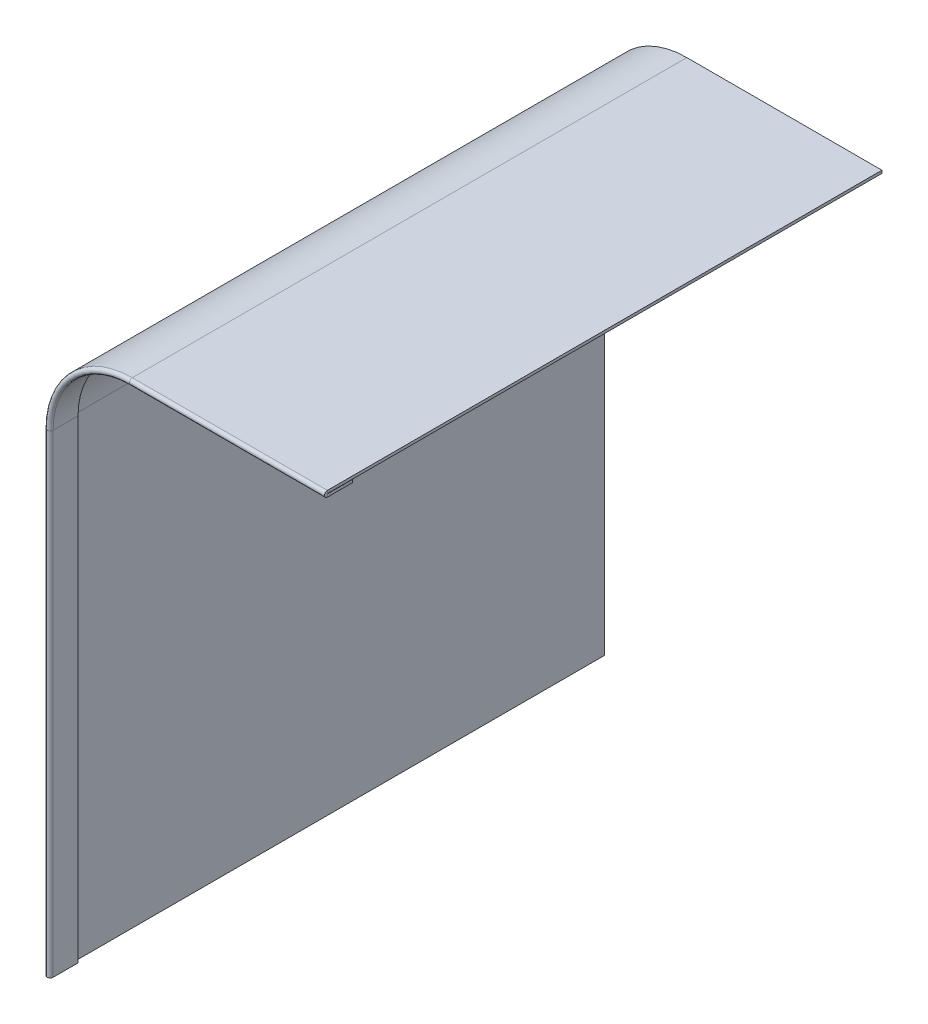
ISO-10303-21;
HEADER;
FILE_DESCRIPTION(('STEP AP214'),'2;1');
FILE_NAME('part.step','',(''),(''),'','','');
FILE_SCHEMA(('AUTOMOTIVE_DESIGN { 1 0 10303 214 1 1 1 1 }'));
ENDSEC;
DATA;
#1=APPLICATION_CONTEXT('core data for automotive mechanical design processes');
#2=APPLICATION_PROTOCOL_DEFINITION('international standard','automotive_design',2000,#1);
#3=PRODUCT_CONTEXT('',#1,'mechanical');
#4=PRODUCT('Part','Part','',(#3));
#5=PRODUCT_RELATED_PRODUCT_CATEGORY('part','',(#4));
#6=PRODUCT_DEFINITION_FORMATION('','',#4);
#7=PRODUCT_DEFINITION_CONTEXT('part definition',#1,'design');
#8=PRODUCT_DEFINITION('design','',#6,#7);
#9=PRODUCT_DEFINITION_SHAPE('','',#8);
#10=(LENGTH_UNIT() NAMED_UNIT(*) SI_UNIT(.MILLI.,.METRE.));
#11=(NAMED_UNIT(*) PLANE_ANGLE_UNIT() SI_UNIT($,.RADIAN.));
#12=(NAMED_UNIT(*) SI_UNIT($,.STERADIAN.) SOLID_ANGLE_UNIT());
#13=UNCERTAINTY_MEASURE_WITH_UNIT(LENGTH_MEASURE(1.E-05),#10,'distance_accuracy_value','');
#14=(GEOMETRIC_REPRESENTATION_CONTEXT(3) GLOBAL_UNCERTAINTY_ASSIGNED_CONTEXT((#13)) GLOBAL_UNIT_ASSIGNED_CONTEXT((#10,
#11,#12)) REPRESENTATION_CONTEXT('',''));
#15=CARTESIAN_POINT('',(0.,0.,0.));
#16=DIRECTION('',(0.,0.,1.));
#17=DIRECTION('',(1.,0.,0.));
#18=AXIS2_PLACEMENT_3D('',#15,#16,#17);
#19=CARTESIAN_POINT('',(30.,-30.,450.328458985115));
#20=DIRECTION('',(0.,0.,-1.));
#21=DIRECTION('',(-1.,0.,0.));
#22=AXIS2_PLACEMENT_3D('',#19,#20,#21);
#23=CYLINDRICAL_SURFACE('',#22,30.5);
#24=DIRECTION('',(0.,0.,-1.));
#25=VECTOR('',#24,1.);
#26=CARTESIAN_POINT('',(-0.500000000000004,-30.,100.));
#27=LINE('',#26,#25);
#28=CARTESIAN_POINT('',(-0.49999999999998,-30.,98.95));
#29=VERTEX_POINT('',#28);
#30=CARTESIAN_POINT('',(-0.499999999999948,-30.,-100.));
#31=VERTEX_POINT('',#30);
#32=EDGE_CURVE('E218',#29,#31,#27,.T.);
#33=ORIENTED_EDGE('',*,*,#32,.F.);
#34=CARTESIAN_POINT('',(30.,-30.,98.95));
#35=DIRECTION('',(0.,0.,1.));
#36=DIRECTION('',(1.,0.,0.));
#37=AXIS2_PLACEMENT_3D('',#34,#35,#36);
#38=CIRCLE('',#37,30.5);
#39=CARTESIAN_POINT('',(30.,0.5,98.9499999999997));
#40=VERTEX_POINT('',#39);
#41=EDGE_CURVE('E12',#29,#40,#38,.F.);
#42=ORIENTED_EDGE('',*,*,#41,.T.);
#43=DIRECTION('',(0.,0.,-1.));
#44=VECTOR('',#43,1.);
#45=CARTESIAN_POINT('',(30.,0.5,100.));
#46=LINE('',#45,#44);
#47=CARTESIAN_POINT('',(30.,0.5,-100.));
#48=VERTEX_POINT('',#47);
#49=EDGE_CURVE('E318',#40,#48,#46,.T.);
#50=ORIENTED_EDGE('',*,*,#49,.T.);
#51=CARTESIAN_POINT('',(30.,-30.,-100.));
#52=DIRECTION('',(0.,0.,-1.));
#53=DIRECTION('',(-1.,0.,0.));
#54=AXIS2_PLACEMENT_3D('',#51,#52,#53);
#55=CIRCLE('',#54,30.5);
#56=EDGE_CURVE('E313',#48,#31,#55,.F.);
#57=ORIENTED_EDGE('',*,*,#56,.T.);
#58=EDGE_LOOP('',(#33,#42,#50,#57));
#59=FACE_BOUND('',#58,.T.);
#60=ADVANCED_FACE('F37',(#59),#23,.T.);
#61=CARTESIAN_POINT('',(524.476189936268,-200.,100.));
#62=DIRECTION('',(0.,1.,0.));
#63=DIRECTION('',(-1.,0.,0.));
#64=AXIS2_PLACEMENT_3D('',#61,#62,#63);
#65=PLANE('',#64);
#66=DIRECTION('',(0.,0.,-1.));
#67=VECTOR('',#66,1.);
#68=CARTESIAN_POINT('',(0.499999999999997,-200.,100.));
#69=LINE('',#68,#67);
#70=CARTESIAN_POINT('',(0.50000000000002,-200.,98.95));
#71=VERTEX_POINT('',#70);
#72=CARTESIAN_POINT('',(0.499999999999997,-200.,-100.));
#73=VERTEX_POINT('',#72);
#74=EDGE_CURVE('E64',#71,#73,#69,.T.);
#75=ORIENTED_EDGE('',*,*,#74,.F.);
#76=DIRECTION('',(-1.,0.,0.));
#77=VECTOR('',#76,1.);
#78=CARTESIAN_POINT('',(0.50000000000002,-200.,98.95));
#79=LINE('',#78,#77);
#80=CARTESIAN_POINT('',(-0.49999999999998,-200.,98.95));
#81=VERTEX_POINT('',#80);
#82=EDGE_CURVE('E281',#71,#81,#79,.T.);
#83=ORIENTED_EDGE('',*,*,#82,.T.);
#84=DIRECTION('',(0.,0.,-1.));
#85=VECTOR('',#84,1.);
#86=CARTESIAN_POINT('',(-0.500000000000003,-200.,100.));
#87=LINE('',#86,#85);
#88=CARTESIAN_POINT('',(-0.499999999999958,-200.,-100.));
#89=VERTEX_POINT('',#88);
#90=EDGE_CURVE('E77',#81,#89,#87,.T.);
#91=ORIENTED_EDGE('',*,*,#90,.T.);
#92=DIRECTION('',(-1.,0.,0.));
#93=VECTOR('',#92,1.);
#94=CARTESIAN_POINT('',(524.476189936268,-200.,-100.));
#95=LINE('',#94,#93);
#96=EDGE_CURVE('E213',#73,#89,#95,.T.);
#97=ORIENTED_EDGE('',*,*,#96,.F.);
#98=EDGE_LOOP('',(#75,#83,#91,#97));
#99=FACE_BOUND('',#98,.T.);
#100=ADVANCED_FACE('F342',(#99),#65,.F.);
#101=CARTESIAN_POINT('',(-0.500000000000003,-200.,100.));
#102=DIRECTION('',(-1.,0.,0.));
#103=DIRECTION('',(0.,0.,1.));
#104=AXIS2_PLACEMENT_3D('',#101,#102,#103);
#105=PLANE('',#104);
#106=DIRECTION('',(0.,-1.,0.));
#107=VECTOR('',#106,1.);
#108=CARTESIAN_POINT('',(-0.49999999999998,-200.,98.95));
#109=LINE('',#108,#107);
#110=EDGE_CURVE('E272',#81,#29,#109,.F.);
#111=ORIENTED_EDGE('',*,*,#110,.T.);
#112=ORIENTED_EDGE('',*,*,#32,.T.);
#113=DIRECTION('',(0.,1.,0.));
#114=VECTOR('',#113,1.);
#115=CARTESIAN_POINT('',(-0.500000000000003,-200.,-100.));
#116=LINE('',#115,#114);
#117=EDGE_CURVE('E215',#89,#31,#116,.T.);
#118=ORIENTED_EDGE('',*,*,#117,.F.);
#119=ORIENTED_EDGE('',*,*,#90,.F.);
#120=EDGE_LOOP('',(#111,#112,#118,#119));
#121=FACE_BOUND('',#120,.T.);
#122=ADVANCED_FACE('F347',(#121),#105,.T.);
#123=CARTESIAN_POINT('',(524.476189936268,-200.,-100.));
#124=DIRECTION('',(0.,0.,1.));
#125=DIRECTION('',(0.,1.,0.));
#126=AXIS2_PLACEMENT_3D('',#123,#124,#125);
#127=PLANE('',#126);
#128=ORIENTED_EDGE('',*,*,#117,.T.);
#129=DIRECTION('',(-1.,0.,0.));
#130=VECTOR('',#129,1.);
#131=CARTESIAN_POINT('',(524.476189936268,-30.,-100.));
#132=LINE('',#131,#130);
#133=CARTESIAN_POINT('',(0.499999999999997,-30.,-100.));
#134=VERTEX_POINT('',#133);
#135=EDGE_CURVE('E221',#134,#31,#132,.T.);
#136=ORIENTED_EDGE('',*,*,#135,.F.);
#137=DIRECTION('',(0.,1.,0.));
#138=VECTOR('',#137,1.);
#139=CARTESIAN_POINT('',(0.499999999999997,-200.,-100.));
#140=LINE('',#139,#138);
#141=EDGE_CURVE('E211',#73,#134,#140,.T.);
#142=ORIENTED_EDGE('',*,*,#141,.F.);
#143=ORIENTED_EDGE('',*,*,#96,.T.);
#144=EDGE_LOOP('',(#128,#136,#142,#143));
#145=FACE_BOUND('',#144,.T.);
#146=ADVANCED_FACE('F439',(#145),#127,.F.);
#147=CARTESIAN_POINT('',(0.499999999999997,-200.,100.));
#148=DIRECTION('',(-1.,0.,0.));
#149=DIRECTION('',(0.,0.,1.));
#150=AXIS2_PLACEMENT_3D('',#147,#148,#149);
#151=PLANE('',#150);
#152=DIRECTION('',(0.,0.,-1.));
#153=VECTOR('',#152,1.);
#154=CARTESIAN_POINT('',(0.499999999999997,-30.,100.));
#155=LINE('',#154,#153);
#156=CARTESIAN_POINT('',(0.50000000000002,-30.,98.95));
#157=VERTEX_POINT('',#156);
#158=EDGE_CURVE('E209',#157,#134,#155,.T.);
#159=ORIENTED_EDGE('',*,*,#158,.F.);
#160=DIRECTION('',(0.,-1.,0.));
#161=VECTOR('',#160,1.);
#162=CARTESIAN_POINT('',(0.50000000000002,-200.,98.95));
#163=LINE('',#162,#161);
#164=EDGE_CURVE('E263',#71,#157,#163,.F.);
#165=ORIENTED_EDGE('',*,*,#164,.F.);
#166=ORIENTED_EDGE('',*,*,#74,.T.);
#167=ORIENTED_EDGE('',*,*,#141,.T.);
#168=EDGE_LOOP('',(#159,#165,#166,#167));
#169=FACE_BOUND('',#168,.T.);
#170=ADVANCED_FACE('F39',(#169),#151,.F.);
#171=CARTESIAN_POINT('',(30.,-423.292402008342,-100.));
#172=DIRECTION('',(0.,0.,1.));
#173=DIRECTION('',(1.,0.,0.));
#174=AXIS2_PLACEMENT_3D('',#171,#172,#173);
#175=PLANE('',#174);
#176=DIRECTION('',(1.,0.,0.));
#177=VECTOR('',#176,1.);
#178=CARTESIAN_POINT('',(30.,0.5,-100.));
#179=LINE('',#178,#177);
#180=CARTESIAN_POINT('',(100.,0.5,-100.));
#181=VERTEX_POINT('',#180);
#182=EDGE_CURVE('E316',#48,#181,#179,.T.);
#183=ORIENTED_EDGE('',*,*,#182,.T.);
#184=DIRECTION('',(0.,1.,0.));
#185=VECTOR('',#184,1.);
#186=CARTESIAN_POINT('',(100.,-423.292402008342,-100.));
#187=LINE('',#186,#185);
#188=CARTESIAN_POINT('',(100.,-0.5,-100.));
#189=VERTEX_POINT('',#188);
#190=EDGE_CURVE('E207',#189,#181,#187,.T.);
#191=ORIENTED_EDGE('',*,*,#190,.F.);
#192=DIRECTION('',(1.,0.,0.));
#193=VECTOR('',#192,1.);
#194=CARTESIAN_POINT('',(30.,-0.5,-100.));
#195=LINE('',#194,#193);
#196=CARTESIAN_POINT('',(30.,-0.5,-100.));
#197=VERTEX_POINT('',#196);
#198=EDGE_CURVE('E197',#197,#189,#195,.T.);
#199=ORIENTED_EDGE('',*,*,#198,.F.);
#200=DIRECTION('',(0.,1.,0.));
#201=VECTOR('',#200,1.);
#202=CARTESIAN_POINT('',(30.,-423.292402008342,-100.));
#203=LINE('',#202,#201);
#204=EDGE_CURVE('E200',#197,#48,#203,.T.);
#205=ORIENTED_EDGE('',*,*,#204,.T.);
#206=EDGE_LOOP('',(#183,#191,#199,#205));
#207=FACE_BOUND('',#206,.T.);
#208=ADVANCED_FACE('F329',(#207),#175,.F.);
#209=CARTESIAN_POINT('',(100.,-423.292402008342,100.));
#210=DIRECTION('',(1.,0.,0.));
#211=DIRECTION('',(0.,0.,-1.));
#212=AXIS2_PLACEMENT_3D('',#209,#210,#211);
#213=PLANE('',#212);
#214=DIRECTION('',(0.,1.,-2.7755575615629E-13));
#215=VECTOR('',#214,1.);
#216=CARTESIAN_POINT('',(100.,-0.5,98.95));
#217=LINE('',#216,#215);
#218=CARTESIAN_POINT('',(100.,-0.5,98.95));
#219=VERTEX_POINT('',#218);
#220=CARTESIAN_POINT('',(100.,0.5,98.9499999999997));
#221=VERTEX_POINT('',#220);
#222=EDGE_CURVE('E182',#219,#221,#217,.T.);
#223=ORIENTED_EDGE('',*,*,#222,.F.);
#224=DIRECTION('',(0.,0.,-1.));
#225=VECTOR('',#224,1.);
#226=CARTESIAN_POINT('',(100.,-0.5,100.));
#227=LINE('',#226,#225);
#228=EDGE_CURVE('E191',#219,#189,#227,.T.);
#229=ORIENTED_EDGE('',*,*,#228,.T.);
#230=ORIENTED_EDGE('',*,*,#190,.T.);
#231=DIRECTION('',(0.,0.,-1.));
#232=VECTOR('',#231,1.);
#233=CARTESIAN_POINT('',(100.,0.5,100.));
#234=LINE('',#233,#232);
#235=EDGE_CURVE('E85',#221,#181,#234,.T.);
#236=ORIENTED_EDGE('',*,*,#235,.F.);
#237=EDGE_LOOP('',(#223,#229,#230,#236));
#238=FACE_BOUND('',#237,.T.);
#239=ADVANCED_FACE('F189',(#238),#213,.T.);
#240=CARTESIAN_POINT('',(30.,-0.5,100.));
#241=DIRECTION('',(0.,1.,0.));
#242=DIRECTION('',(0.,0.,1.));
#243=AXIS2_PLACEMENT_3D('',#240,#241,#242);
#244=PLANE('',#243);
#245=ORIENTED_EDGE('',*,*,#228,.F.);
#246=DIRECTION('',(-1.,0.,0.));
#247=VECTOR('',#246,1.);
#248=CARTESIAN_POINT('',(30.,-0.5,98.95));
#249=LINE('',#248,#247);
#250=CARTESIAN_POINT('',(30.,-0.5,98.95));
#251=VERTEX_POINT('',#250);
#252=EDGE_CURVE('E171',#251,#219,#249,.F.);
#253=ORIENTED_EDGE('',*,*,#252,.F.);
#254=DIRECTION('',(0.,0.,-1.));
#255=VECTOR('',#254,1.);
#256=CARTESIAN_POINT('',(30.,-0.5,100.));
#257=LINE('',#256,#255);
#258=EDGE_CURVE('E92',#251,#197,#257,.T.);
#259=ORIENTED_EDGE('',*,*,#258,.T.);
#260=ORIENTED_EDGE('',*,*,#198,.T.);
#261=EDGE_LOOP('',(#245,#253,#259,#260));
#262=FACE_BOUND('',#261,.T.);
#263=ADVANCED_FACE('F195',(#262),#244,.F.);
#264=CARTESIAN_POINT('',(30.,0.5,100.));
#265=DIRECTION('',(0.,1.,0.));
#266=DIRECTION('',(0.,0.,1.));
#267=AXIS2_PLACEMENT_3D('',#264,#265,#266);
#268=PLANE('',#267);
#269=DIRECTION('',(-1.,0.,0.));
#270=VECTOR('',#269,1.);
#271=CARTESIAN_POINT('',(30.,0.5,98.9499999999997));
#272=LINE('',#271,#270);
#273=EDGE_CURVE('E233',#40,#221,#272,.F.);
#274=ORIENTED_EDGE('',*,*,#273,.T.);
#275=ORIENTED_EDGE('',*,*,#235,.T.);
#276=ORIENTED_EDGE('',*,*,#182,.F.);
#277=ORIENTED_EDGE('',*,*,#49,.F.);
#278=EDGE_LOOP('',(#274,#275,#276,#277));
#279=FACE_BOUND('',#278,.T.);
#280=ADVANCED_FACE('F330',(#279),#268,.T.);
#281=CARTESIAN_POINT('',(30.,-30.,-100.));
#282=DIRECTION('',(0.,0.,-1.));
#283=DIRECTION('',(-1.,0.,0.));
#284=AXIS2_PLACEMENT_3D('',#281,#282,#283);
#285=PLANE('',#284);
#286=ORIENTED_EDGE('',*,*,#204,.F.);
#287=CARTESIAN_POINT('',(30.,-30.,-100.));
#288=DIRECTION('',(0.,0.,-1.));
#289=DIRECTION('',(-1.,0.,0.));
#290=AXIS2_PLACEMENT_3D('',#287,#288,#289);
#291=CIRCLE('',#290,29.5);
#292=EDGE_CURVE('E310',#197,#134,#291,.F.);
#293=ORIENTED_EDGE('',*,*,#292,.T.);
#294=ORIENTED_EDGE('',*,*,#135,.T.);
#295=ORIENTED_EDGE('',*,*,#56,.F.);
#296=EDGE_LOOP('',(#286,#293,#294,#295));
#297=FACE_BOUND('',#296,.T.);
#298=ADVANCED_FACE('F326',(#297),#285,.T.);
#299=CARTESIAN_POINT('',(30.,-30.,450.328458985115));
#300=DIRECTION('',(0.,0.,-1.));
#301=DIRECTION('',(-1.,0.,0.));
#302=AXIS2_PLACEMENT_3D('',#299,#300,#301);
#303=CYLINDRICAL_SURFACE('',#302,29.5);
#304=CARTESIAN_POINT('',(30.,-30.,98.95));
#305=DIRECTION('',(0.,0.,1.));
#306=DIRECTION('',(1.,0.,0.));
#307=AXIS2_PLACEMENT_3D('',#304,#305,#306);
#308=CIRCLE('',#307,29.5);
#309=EDGE_CURVE('E47',#157,#251,#308,.F.);
#310=ORIENTED_EDGE('',*,*,#309,.F.);
#311=ORIENTED_EDGE('',*,*,#158,.T.);
#312=ORIENTED_EDGE('',*,*,#292,.F.);
#313=ORIENTED_EDGE('',*,*,#258,.F.);
#314=EDGE_LOOP('',(#310,#311,#312,#313));
#315=FACE_BOUND('',#314,.T.);
#316=ADVANCED_FACE('F338',(#315),#303,.F.);
#317=CARTESIAN_POINT('',(1.6,-200.,94.475));
#318=DIRECTION('',(0.,1.,0.));
#319=DIRECTION('',(0.,0.,1.));
#320=AXIS2_PLACEMENT_3D('',#317,#318,#319);
#321=PLANE('',#320);
#322=DIRECTION('',(1.,0.,0.));
#323=VECTOR('',#322,1.);
#324=CARTESIAN_POINT('',(1.6,-200.,98.95));
#325=LINE('',#324,#323);
#326=CARTESIAN_POINT('',(0.599999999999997,-200.,98.95));
#327=VERTEX_POINT('',#326);
#328=CARTESIAN_POINT('',(1.6,-200.,98.95));
#329=VERTEX_POINT('',#328);
#330=EDGE_CURVE('E307',#327,#329,#325,.T.);
#331=ORIENTED_EDGE('',*,*,#330,.F.);
#332=DIRECTION('',(0.,0.,-1.));
#333=VECTOR('',#332,1.);
#334=CARTESIAN_POINT('',(0.599999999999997,-200.,94.475));
#335=LINE('',#334,#333);
#336=CARTESIAN_POINT('',(0.599999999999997,-200.,90.));
#337=VERTEX_POINT('',#336);
#338=EDGE_CURVE('E288',#337,#327,#335,.F.);
#339=ORIENTED_EDGE('',*,*,#338,.F.);
#340=DIRECTION('',(1.,0.,0.));
#341=VECTOR('',#340,1.);
#342=CARTESIAN_POINT('',(1.6,-200.,90.));
#343=LINE('',#342,#341);
#344=CARTESIAN_POINT('',(1.6,-200.,90.));
#345=VERTEX_POINT('',#344);
#346=EDGE_CURVE('E297',#337,#345,#343,.T.);
#347=ORIENTED_EDGE('',*,*,#346,.T.);
#348=DIRECTION('',(0.,0.,1.));
#349=VECTOR('',#348,1.);
#350=CARTESIAN_POINT('',(1.6,-200.,94.475));
#351=LINE('',#350,#349);
#352=EDGE_CURVE('E298',#345,#329,#351,.T.);
#353=ORIENTED_EDGE('',*,*,#352,.T.);
#354=EDGE_LOOP('',(#331,#339,#347,#353));
#355=FACE_BOUND('',#354,.T.);
#356=ADVANCED_FACE('F352',(#355),#321,.F.);
#357=CARTESIAN_POINT('',(1.6,-115.,90.));
#358=DIRECTION('',(0.,0.,1.));
#359=DIRECTION('',(0.,-1.,0.));
#360=AXIS2_PLACEMENT_3D('',#357,#358,#359);
#361=PLANE('',#360);
#362=ORIENTED_EDGE('',*,*,#346,.F.);
#363=DIRECTION('',(0.,1.,0.));
#364=VECTOR('',#363,1.);
#365=CARTESIAN_POINT('',(0.599999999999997,-115.,90.));
#366=LINE('',#365,#364);
#367=CARTESIAN_POINT('',(0.599999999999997,-30.,90.));
#368=VERTEX_POINT('',#367);
#369=EDGE_CURVE('E284',#368,#337,#366,.F.);
#370=ORIENTED_EDGE('',*,*,#369,.F.);
#371=CARTESIAN_POINT('',(30.,-30.,90.));
#372=DIRECTION('',(0.,0.,1.));
#373=DIRECTION('',(1.,0.,0.));
#374=AXIS2_PLACEMENT_3D('',#371,#372,#373);
#375=CIRCLE('',#374,29.4);
#376=CARTESIAN_POINT('',(30.,-0.6,90.));
#377=VERTEX_POINT('',#376);
#378=EDGE_CURVE('E435',#377,#368,#375,.T.);
#379=ORIENTED_EDGE('',*,*,#378,.F.);
#380=DIRECTION('',(1.,0.,0.));
#381=VECTOR('',#380,1.);
#382=CARTESIAN_POINT('',(65.,-0.6,90.));
#383=LINE('',#382,#381);
#384=CARTESIAN_POINT('',(100.,-0.6,90.));
#385=VERTEX_POINT('',#384);
#386=EDGE_CURVE('E237',#385,#377,#383,.F.);
#387=ORIENTED_EDGE('',*,*,#386,.F.);
#388=DIRECTION('',(0.,-1.,0.));
#389=VECTOR('',#388,1.);
#390=CARTESIAN_POINT('',(100.,-1.6,90.));
#391=LINE('',#390,#389);
#392=CARTESIAN_POINT('',(100.,-1.6,90.));
#393=VERTEX_POINT('',#392);
#394=EDGE_CURVE('E249',#385,#393,#391,.T.);
#395=ORIENTED_EDGE('',*,*,#394,.T.);
#396=DIRECTION('',(-1.,0.,0.));
#397=VECTOR('',#396,1.);
#398=CARTESIAN_POINT('',(65.,-1.6,90.));
#399=LINE('',#398,#397);
#400=CARTESIAN_POINT('',(30.,-1.6,90.));
#401=VERTEX_POINT('',#400);
#402=EDGE_CURVE('E246',#393,#401,#399,.T.);
#403=ORIENTED_EDGE('',*,*,#402,.T.);
#404=CARTESIAN_POINT('',(30.,-30.,90.));
#405=DIRECTION('',(0.,0.,1.));
#406=DIRECTION('',(1.,0.,0.));
#407=AXIS2_PLACEMENT_3D('',#404,#405,#406);
#408=CIRCLE('',#407,28.4);
#409=CARTESIAN_POINT('',(1.6,-30.,90.));
#410=VERTEX_POINT('',#409);
#411=EDGE_CURVE('E421',#401,#410,#408,.T.);
#412=ORIENTED_EDGE('',*,*,#411,.T.);
#413=DIRECTION('',(0.,-1.,0.));
#414=VECTOR('',#413,1.);
#415=CARTESIAN_POINT('',(1.6,-115.,90.));
#416=LINE('',#415,#414);
#417=EDGE_CURVE('E294',#410,#345,#416,.T.);
#418=ORIENTED_EDGE('',*,*,#417,.T.);
#419=EDGE_LOOP('',(#362,#370,#379,#387,#395,#403,#412,#418));
#420=FACE_BOUND('',#419,.T.);
#421=ADVANCED_FACE('F356',(#420),#361,.F.);
#422=CARTESIAN_POINT('',(1.6,-115.,94.475));
#423=DIRECTION('',(1.,0.,0.));
#424=DIRECTION('',(0.,0.,-1.));
#425=AXIS2_PLACEMENT_3D('',#422,#423,#424);
#426=PLANE('',#425);
#427=ORIENTED_EDGE('',*,*,#417,.F.);
#428=DIRECTION('',(0.,0.,-1.));
#429=VECTOR('',#428,1.);
#430=CARTESIAN_POINT('',(1.6,-30.,94.475));
#431=LINE('',#430,#429);
#432=CARTESIAN_POINT('',(1.6,-30.,98.95));
#433=VERTEX_POINT('',#432);
#434=EDGE_CURVE('E287',#433,#410,#431,.T.);
#435=ORIENTED_EDGE('',*,*,#434,.F.);
#436=DIRECTION('',(0.,1.,0.));
#437=VECTOR('',#436,1.);
#438=CARTESIAN_POINT('',(1.6,-115.,98.95));
#439=LINE('',#438,#437);
#440=EDGE_CURVE('E301',#329,#433,#439,.T.);
#441=ORIENTED_EDGE('',*,*,#440,.F.);
#442=ORIENTED_EDGE('',*,*,#352,.F.);
#443=EDGE_LOOP('',(#427,#435,#441,#442));
#444=FACE_BOUND('',#443,.T.);
#445=ADVANCED_FACE('F360',(#444),#426,.T.);
#446=CARTESIAN_POINT('',(0.599999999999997,-115.,94.475));
#447=DIRECTION('',(1.,0.,0.));
#448=DIRECTION('',(0.,0.,-1.));
#449=AXIS2_PLACEMENT_3D('',#446,#447,#448);
#450=PLANE('',#449);
#451=ORIENTED_EDGE('',*,*,#369,.T.);
#452=ORIENTED_EDGE('',*,*,#338,.T.);
#453=DIRECTION('',(0.,1.,0.));
#454=VECTOR('',#453,1.);
#455=CARTESIAN_POINT('',(0.599999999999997,-115.,98.95));
#456=LINE('',#455,#454);
#457=CARTESIAN_POINT('',(0.599999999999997,-30.,98.95));
#458=VERTEX_POINT('',#457);
#459=EDGE_CURVE('E291',#327,#458,#456,.T.);
#460=ORIENTED_EDGE('',*,*,#459,.T.);
#461=DIRECTION('',(0.,0.,-1.));
#462=VECTOR('',#461,1.);
#463=CARTESIAN_POINT('',(0.599999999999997,-30.,94.475));
#464=LINE('',#463,#462);
#465=EDGE_CURVE('E283',#458,#368,#464,.T.);
#466=ORIENTED_EDGE('',*,*,#465,.T.);
#467=EDGE_LOOP('',(#451,#452,#460,#466));
#468=FACE_BOUND('',#467,.T.);
#469=ADVANCED_FACE('F364',(#468),#450,.F.);
#470=CARTESIAN_POINT('',(0.550000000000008,-200.,98.95));
#471=DIRECTION('',(0.,1.,0.));
#472=DIRECTION('',(0.,0.,1.));
#473=AXIS2_PLACEMENT_3D('',#470,#471,#472);
#474=PLANE('',#473);
#475=CARTESIAN_POINT('',(0.550000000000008,-200.,98.95));
#476=DIRECTION('',(0.,-1.,0.));
#477=DIRECTION('',(0.,0.,-1.));
#478=AXIS2_PLACEMENT_3D('',#475,#476,#477);
#479=CIRCLE('',#478,0.0499999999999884);
#480=EDGE_CURVE('E259',#327,#71,#479,.T.);
#481=ORIENTED_EDGE('',*,*,#480,.F.);
#482=ORIENTED_EDGE('',*,*,#330,.T.);
#483=CARTESIAN_POINT('',(0.550000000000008,-200.,98.95));
#484=DIRECTION('',(0.,-1.,0.));
#485=DIRECTION('',(0.,0.,-1.));
#486=AXIS2_PLACEMENT_3D('',#483,#484,#485);
#487=CIRCLE('',#486,1.04999999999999);
#488=EDGE_CURVE('E266',#329,#81,#487,.T.);
#489=ORIENTED_EDGE('',*,*,#488,.T.);
#490=ORIENTED_EDGE('',*,*,#82,.F.);
#491=EDGE_LOOP('',(#481,#482,#489,#490));
#492=FACE_BOUND('',#491,.T.);
#493=ADVANCED_FACE('F368',(#492),#474,.F.);
#494=CARTESIAN_POINT('',(0.550000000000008,-200.,98.95));
#495=DIRECTION('',(0.,-1.,0.));
#496=DIRECTION('',(1.,0.,0.));
#497=AXIS2_PLACEMENT_3D('',#494,#495,#496);
#498=CYLINDRICAL_SURFACE('',#497,1.04999999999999);
#499=ORIENTED_EDGE('',*,*,#110,.F.);
#500=ORIENTED_EDGE('',*,*,#488,.F.);
#501=ORIENTED_EDGE('',*,*,#440,.T.);
#502=CARTESIAN_POINT('',(0.550000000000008,-30.,98.95));
#503=DIRECTION('',(0.,-1.,0.));
#504=DIRECTION('',(0.,0.,-1.));
#505=AXIS2_PLACEMENT_3D('',#502,#503,#504);
#506=CIRCLE('',#505,1.04999999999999);
#507=EDGE_CURVE('E41',#29,#433,#506,.F.);
#508=ORIENTED_EDGE('',*,*,#507,.F.);
#509=EDGE_LOOP('',(#499,#500,#501,#508));
#510=FACE_BOUND('',#509,.T.);
#511=ADVANCED_FACE('F370',(#510),#498,.T.);
#512=CARTESIAN_POINT('',(0.550000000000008,-200.,98.95));
#513=DIRECTION('',(0.,-1.,0.));
#514=DIRECTION('',(1.,0.,0.));
#515=AXIS2_PLACEMENT_3D('',#512,#513,#514);
#516=CYLINDRICAL_SURFACE('',#515,0.0499999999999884);
#517=ORIENTED_EDGE('',*,*,#164,.T.);
#518=CARTESIAN_POINT('',(0.550000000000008,-30.,98.95));
#519=DIRECTION('',(0.,-1.,0.));
#520=DIRECTION('',(0.,0.,-1.));
#521=AXIS2_PLACEMENT_3D('',#518,#519,#520);
#522=CIRCLE('',#521,0.0499999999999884);
#523=EDGE_CURVE('E265',#157,#458,#522,.F.);
#524=ORIENTED_EDGE('',*,*,#523,.T.);
#525=ORIENTED_EDGE('',*,*,#459,.F.);
#526=ORIENTED_EDGE('',*,*,#480,.T.);
#527=EDGE_LOOP('',(#517,#524,#525,#526));
#528=FACE_BOUND('',#527,.T.);
#529=ADVANCED_FACE('F374',(#528),#516,.F.);
#530=CARTESIAN_POINT('',(100.,-1.6,94.475));
#531=DIRECTION('',(-1.,0.,0.));
#532=DIRECTION('',(0.,0.,-1.));
#533=AXIS2_PLACEMENT_3D('',#530,#531,#532);
#534=PLANE('',#533);
#535=DIRECTION('',(0.,0.,-1.));
#536=VECTOR('',#535,1.);
#537=CARTESIAN_POINT('',(100.,-0.6,94.475));
#538=LINE('',#537,#536);
#539=CARTESIAN_POINT('',(100.,-0.6,98.95));
#540=VERTEX_POINT('',#539);
#541=EDGE_CURVE('E192',#540,#385,#538,.T.);
#542=ORIENTED_EDGE('',*,*,#541,.F.);
#543=DIRECTION('',(0.,-1.,0.));
#544=VECTOR('',#543,1.);
#545=CARTESIAN_POINT('',(100.,-1.6,98.95));
#546=LINE('',#545,#544);
#547=CARTESIAN_POINT('',(100.,-1.6,98.95));
#548=VERTEX_POINT('',#547);
#549=EDGE_CURVE('E185',#540,#548,#546,.T.);
#550=ORIENTED_EDGE('',*,*,#549,.T.);
#551=DIRECTION('',(0.,0.,-1.));
#552=VECTOR('',#551,1.);
#553=CARTESIAN_POINT('',(100.,-1.6,94.475));
#554=LINE('',#553,#552);
#555=EDGE_CURVE('E239',#548,#393,#554,.T.);
#556=ORIENTED_EDGE('',*,*,#555,.T.);
#557=ORIENTED_EDGE('',*,*,#394,.F.);
#558=EDGE_LOOP('',(#542,#550,#556,#557));
#559=FACE_BOUND('',#558,.T.);
#560=ADVANCED_FACE('F380',(#559),#534,.F.);
#561=CARTESIAN_POINT('',(65.,-1.6,94.475));
#562=DIRECTION('',(0.,-1.,0.));
#563=DIRECTION('',(0.,0.,-1.));
#564=AXIS2_PLACEMENT_3D('',#561,#562,#563);
#565=PLANE('',#564);
#566=ORIENTED_EDGE('',*,*,#402,.F.);
#567=ORIENTED_EDGE('',*,*,#555,.F.);
#568=DIRECTION('',(1.,0.,0.));
#569=VECTOR('',#568,1.);
#570=CARTESIAN_POINT('',(65.,-1.6,98.95));
#571=LINE('',#570,#569);
#572=CARTESIAN_POINT('',(30.,-1.6,98.95));
#573=VERTEX_POINT('',#572);
#574=EDGE_CURVE('E253',#573,#548,#571,.T.);
#575=ORIENTED_EDGE('',*,*,#574,.F.);
#576=DIRECTION('',(0.,0.,1.));
#577=VECTOR('',#576,1.);
#578=CARTESIAN_POINT('',(30.,-1.6,94.475));
#579=LINE('',#578,#577);
#580=EDGE_CURVE('E250',#401,#573,#579,.T.);
#581=ORIENTED_EDGE('',*,*,#580,.F.);
#582=EDGE_LOOP('',(#566,#567,#575,#581));
#583=FACE_BOUND('',#582,.T.);
#584=ADVANCED_FACE('F381',(#583),#565,.T.);
#585=CARTESIAN_POINT('',(65.,-0.6,94.475));
#586=DIRECTION('',(0.,-1.,0.));
#587=DIRECTION('',(0.,0.,-1.));
#588=AXIS2_PLACEMENT_3D('',#585,#586,#587);
#589=PLANE('',#588);
#590=ORIENTED_EDGE('',*,*,#386,.T.);
#591=DIRECTION('',(0.,0.,-1.));
#592=VECTOR('',#591,1.);
#593=CARTESIAN_POINT('',(30.,-0.6,94.475));
#594=LINE('',#593,#592);
#595=CARTESIAN_POINT('',(30.,-0.6,98.95));
#596=VERTEX_POINT('',#595);
#597=EDGE_CURVE('E240',#377,#596,#594,.F.);
#598=ORIENTED_EDGE('',*,*,#597,.T.);
#599=DIRECTION('',(1.,0.,0.));
#600=VECTOR('',#599,1.);
#601=CARTESIAN_POINT('',(65.,-0.6,98.95));
#602=LINE('',#601,#600);
#603=EDGE_CURVE('E242',#596,#540,#602,.T.);
#604=ORIENTED_EDGE('',*,*,#603,.T.);
#605=ORIENTED_EDGE('',*,*,#541,.T.);
#606=EDGE_LOOP('',(#590,#598,#604,#605));
#607=FACE_BOUND('',#606,.T.);
#608=ADVANCED_FACE('F385',(#607),#589,.F.);
#609=CARTESIAN_POINT('',(100.,-0.55,98.95));
#610=DIRECTION('',(1.,0.,0.));
#611=DIRECTION('',(0.,0.,-1.));
#612=AXIS2_PLACEMENT_3D('',#609,#610,#611);
#613=PLANE('',#612);
#614=ORIENTED_EDGE('',*,*,#549,.F.);
#615=CARTESIAN_POINT('',(100.,-0.55,98.95));
#616=DIRECTION('',(-1.,0.,0.));
#617=DIRECTION('',(0.,0.,1.));
#618=AXIS2_PLACEMENT_3D('',#615,#616,#617);
#619=CIRCLE('',#618,0.0499999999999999);
#620=EDGE_CURVE('E174',#219,#540,#619,.F.);
#621=ORIENTED_EDGE('',*,*,#620,.F.);
#622=ORIENTED_EDGE('',*,*,#222,.T.);
#623=CARTESIAN_POINT('',(100.,-0.55,98.95));
#624=DIRECTION('',(-1.,0.,0.));
#625=DIRECTION('',(0.,0.,1.));
#626=AXIS2_PLACEMENT_3D('',#623,#624,#625);
#627=CIRCLE('',#626,1.05);
#628=EDGE_CURVE('E193',#221,#548,#627,.F.);
#629=ORIENTED_EDGE('',*,*,#628,.T.);
#630=EDGE_LOOP('',(#614,#621,#622,#629));
#631=FACE_BOUND('',#630,.T.);
#632=ADVANCED_FACE('F180',(#631),#613,.T.);
#633=CARTESIAN_POINT('',(30.,-0.55,98.95));
#634=DIRECTION('',(-1.,0.,0.));
#635=DIRECTION('',(0.,-1.,0.));
#636=AXIS2_PLACEMENT_3D('',#633,#634,#635);
#637=CYLINDRICAL_SURFACE('',#636,1.05);
#638=ORIENTED_EDGE('',*,*,#273,.F.);
#639=CARTESIAN_POINT('',(30.,-0.55,98.95));
#640=DIRECTION('',(-1.,0.,0.));
#641=DIRECTION('',(0.,0.,1.));
#642=AXIS2_PLACEMENT_3D('',#639,#640,#641);
#643=CIRCLE('',#642,1.05);
#644=EDGE_CURVE('E186',#573,#40,#643,.T.);
#645=ORIENTED_EDGE('',*,*,#644,.F.);
#646=ORIENTED_EDGE('',*,*,#574,.T.);
#647=ORIENTED_EDGE('',*,*,#628,.F.);
#648=EDGE_LOOP('',(#638,#645,#646,#647));
#649=FACE_BOUND('',#648,.T.);
#650=ADVANCED_FACE('F394',(#649),#637,.T.);
#651=CARTESIAN_POINT('',(30.,-0.55,98.95));
#652=DIRECTION('',(-1.,0.,0.));
#653=DIRECTION('',(0.,-1.,0.));
#654=AXIS2_PLACEMENT_3D('',#651,#652,#653);
#655=CYLINDRICAL_SURFACE('',#654,0.0499999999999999);
#656=ORIENTED_EDGE('',*,*,#252,.T.);
#657=ORIENTED_EDGE('',*,*,#620,.T.);
#658=ORIENTED_EDGE('',*,*,#603,.F.);
#659=CARTESIAN_POINT('',(30.,-0.55,98.95));
#660=DIRECTION('',(-1.,0.,0.));
#661=DIRECTION('',(0.,0.,1.));
#662=AXIS2_PLACEMENT_3D('',#659,#660,#661);
#663=CIRCLE('',#662,0.0499999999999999);
#664=EDGE_CURVE('E55',#596,#251,#663,.T.);
#665=ORIENTED_EDGE('',*,*,#664,.T.);
#666=EDGE_LOOP('',(#656,#657,#658,#665));
#667=FACE_BOUND('',#666,.T.);
#668=ADVANCED_FACE('F173',(#667),#655,.F.);
#669=CARTESIAN_POINT('',(30.,-30.,98.95));
#670=DIRECTION('',(0.,0.,1.));
#671=DIRECTION('',(1.,0.,0.));
#672=AXIS2_PLACEMENT_3D('',#669,#670,#671);
#673=TOROIDAL_SURFACE('',#672,29.45,1.04999999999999);
#674=CARTESIAN_POINT('',(30.,-30.,98.95));
#675=DIRECTION('',(0.,0.,1.));
#676=DIRECTION('',(1.,0.,0.));
#677=AXIS2_PLACEMENT_3D('',#674,#675,#676);
#678=CIRCLE('',#677,28.4);
#679=EDGE_CURVE('E229',#573,#433,#678,.T.);
#680=ORIENTED_EDGE('',*,*,#679,.F.);
#681=ORIENTED_EDGE('',*,*,#644,.T.);
#682=ORIENTED_EDGE('',*,*,#41,.F.);
#683=ORIENTED_EDGE('',*,*,#507,.T.);
#684=EDGE_LOOP('',(#680,#681,#682,#683));
#685=FACE_BOUND('',#684,.T.);
#686=ADVANCED_FACE('F400',(#685),#673,.T.);
#687=CARTESIAN_POINT('',(30.,-30.,98.95));
#688=DIRECTION('',(0.,0.,1.));
#689=DIRECTION('',(1.,0.,0.));
#690=AXIS2_PLACEMENT_3D('',#687,#688,#689);
#691=CYLINDRICAL_SURFACE('',#690,28.4);
#692=ORIENTED_EDGE('',*,*,#411,.F.);
#693=ORIENTED_EDGE('',*,*,#580,.T.);
#694=ORIENTED_EDGE('',*,*,#679,.T.);
#695=ORIENTED_EDGE('',*,*,#434,.T.);
#696=EDGE_LOOP('',(#692,#693,#694,#695));
#697=FACE_BOUND('',#696,.T.);
#698=ADVANCED_FACE('F401',(#697),#691,.F.);
#699=CARTESIAN_POINT('',(30.,-30.,98.95));
#700=DIRECTION('',(0.,0.,1.));
#701=DIRECTION('',(1.,0.,0.));
#702=AXIS2_PLACEMENT_3D('',#699,#700,#701);
#703=CYLINDRICAL_SURFACE('',#702,29.4);
#704=CARTESIAN_POINT('',(30.,-30.,98.95));
#705=DIRECTION('',(0.,0.,1.));
#706=DIRECTION('',(1.,0.,0.));
#707=AXIS2_PLACEMENT_3D('',#704,#705,#706);
#708=CIRCLE('',#707,29.4);
#709=EDGE_CURVE('E433',#596,#458,#708,.T.);
#710=ORIENTED_EDGE('',*,*,#709,.F.);
#711=ORIENTED_EDGE('',*,*,#597,.F.);
#712=ORIENTED_EDGE('',*,*,#378,.T.);
#713=ORIENTED_EDGE('',*,*,#465,.F.);
#714=EDGE_LOOP('',(#710,#711,#712,#713));
#715=FACE_BOUND('',#714,.T.);
#716=ADVANCED_FACE('F404',(#715),#703,.T.);
#717=CARTESIAN_POINT('',(30.,-30.,98.95));
#718=DIRECTION('',(0.,0.,1.));
#719=DIRECTION('',(1.,0.,0.));
#720=AXIS2_PLACEMENT_3D('',#717,#718,#719);
#721=TOROIDAL_SURFACE('',#720,29.45,0.0499999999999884);
#722=ORIENTED_EDGE('',*,*,#309,.T.);
#723=ORIENTED_EDGE('',*,*,#664,.F.);
#724=ORIENTED_EDGE('',*,*,#709,.T.);
#725=ORIENTED_EDGE('',*,*,#523,.F.);
#726=EDGE_LOOP('',(#722,#723,#724,#725));
#727=FACE_BOUND('',#726,.T.);
#728=ADVANCED_FACE('F408',(#727),#721,.F.);
#729=CLOSED_SHELL('',(#60,#100,#122,#146,#170,#208,#239,#263,#280,#298,#316,#356,#421,#445,#469,
#493,#511,#529,#560,#584,#608,#632,#650,#668,#686,#698,#716,#728));
#730=MANIFOLD_SOLID_BREP('B2',#729);
#731=ADVANCED_BREP_SHAPE_REPRESENTATION('',(#18,#730),#14);
#732=SHAPE_DEFINITION_REPRESENTATION(#9,#731);
ENDSEC;
END-ISO-10303-21;
